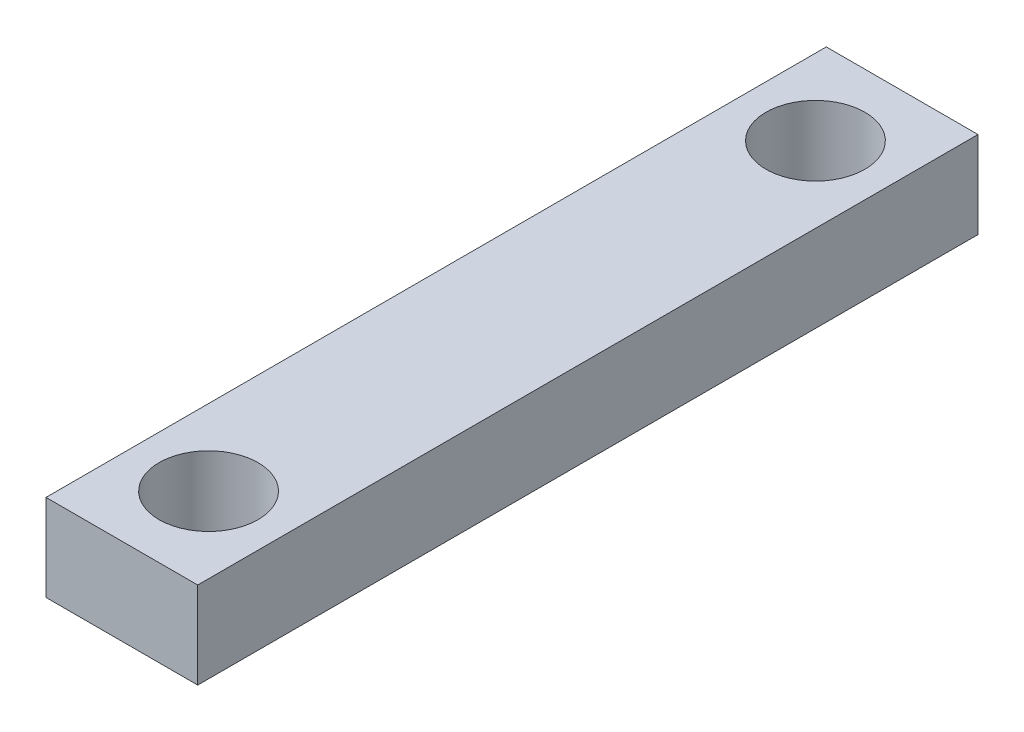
from build123d import *

# Parameters (mm, degrees)
SKETCH2_W      = 11.1125
SKETCH2_H      = 57.15
SKETCH2_R      = 3.622440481
EXTRUDE1_DEPTH = 6.35


with BuildPart() as part:
    # Sketch2 → Extrude1 (new body)
    with BuildSketch(Plane(origin=(0, 0, 0), x_dir=(1, 0, 0), z_dir=(0, 1, 0))):
        with Locations((0, 28.575)):
            Rectangle(SKETCH2_W, SKETCH2_H)
        with Locations(Location((0, 6.35, 0), (0, 0, 270))):
            Circle(SKETCH2_R, mode=Mode.SUBTRACT)
        with Locations(Location((0, 50.8, 0), (0, 0, 90))):
            Circle(SKETCH2_R, mode=Mode.SUBTRACT)
    extrude(amount=EXTRUDE1_DEPTH)


solid = part.part
